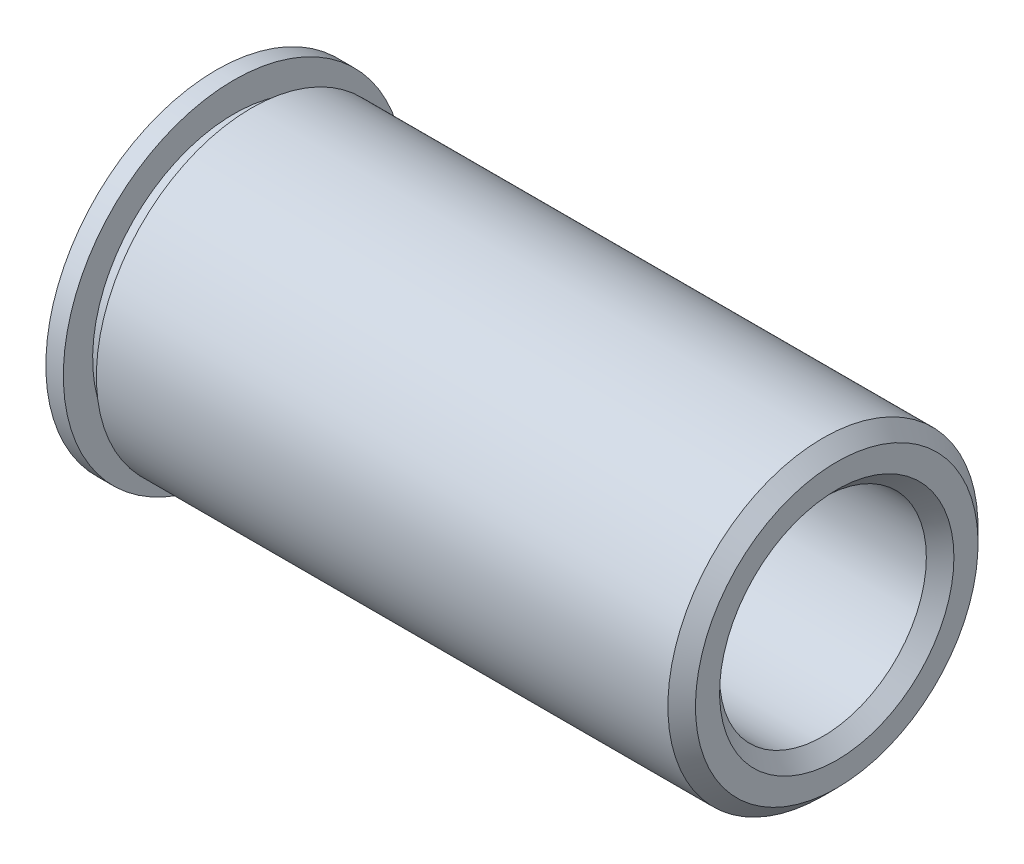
from build123d import *

# Parameters (mm, degrees)
SKETCH2_R          = 1.5
CUT_EXTRUDE1_DEPTH = 10.65666868
CHAMFER1_SIZE      = 0.2
CHAMFER2_SIZE      = 0.2


with BuildPart() as part:
    # Sketch1 → Revolve1 (revolve)
    with BuildSketch(Plane.XY, mode=Mode.PRIVATE) as revolve1_sk:
        Polygon((78.213672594, 0), (78.213672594, 2.25), (69.721672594, 2.25), (69.721672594, 2.05), (69.467672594, 2.05), (69.467672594, 2.475), (69.213672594, 2.475), (69.213672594, 0), align=None)
    revolve(revolve1_sk.sketch.rotate(Axis((-67.824902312, 0, 0), (1, 0, 0)), 180), axis=Axis((-67.824902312, 0, 0), (1, 0, 0)))

    # Sketch2 → Cut-Extrude1 (cut, through all)
    with BuildSketch(Plane(origin=(78.213672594, 0, 0), x_dir=(0, 0, -1), z_dir=(1, 0, 0))):
        Circle(SKETCH2_R)
    extrude(amount=-CUT_EXTRUDE1_DEPTH, mode=Mode.SUBTRACT)

    # Chamfer1
    chamfer1_edges = [part.edges().sort_by_distance(p)[0] for p in [
        (78.213672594, 2.25, 0),
    ]]
    chamfer(chamfer1_edges, length=CHAMFER1_SIZE)

    # Chamfer2
    chamfer2_edges = [part.edges().sort_by_distance(p)[0] for p in [
        (69.213672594, 0, 1.5),
        (78.213672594, 0, 1.5),
    ]]
    chamfer(chamfer2_edges, length=CHAMFER2_SIZE)


solid = part.part
